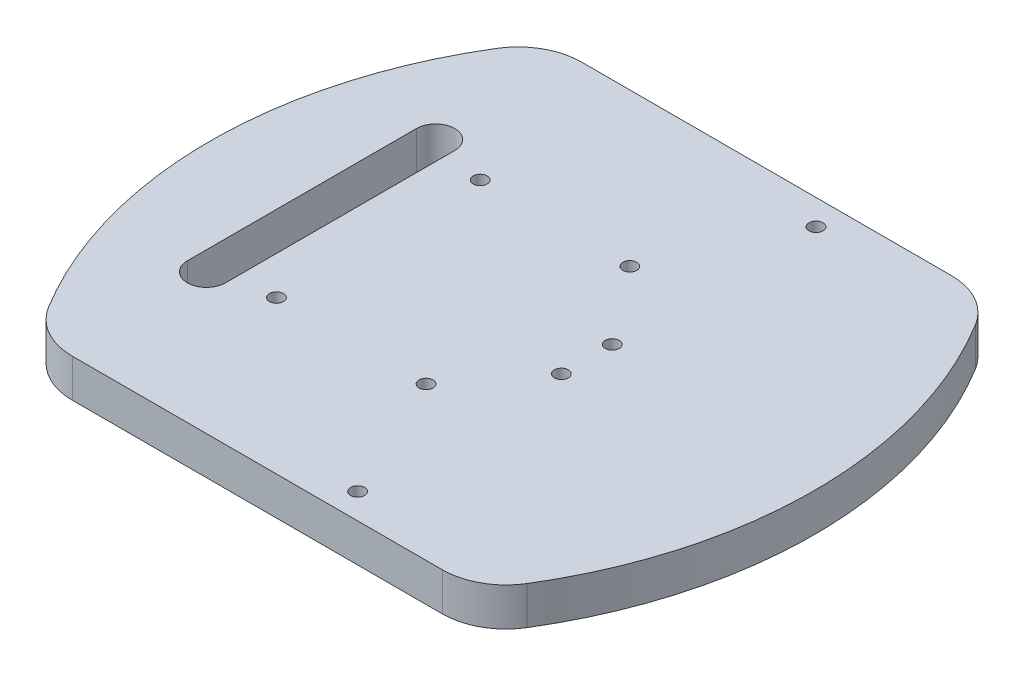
ISO-10303-21;
HEADER;
FILE_DESCRIPTION(('STEP AP214'),'2;1');
FILE_NAME('part.step','',(''),(''),'','','');
FILE_SCHEMA(('AUTOMOTIVE_DESIGN { 1 0 10303 214 1 1 1 1 }'));
ENDSEC;
DATA;
#1=APPLICATION_CONTEXT('core data for automotive mechanical design processes');
#2=APPLICATION_PROTOCOL_DEFINITION('international standard','automotive_design',2000,#1);
#3=PRODUCT_CONTEXT('',#1,'mechanical');
#4=PRODUCT('Part','Part','',(#3));
#5=PRODUCT_RELATED_PRODUCT_CATEGORY('part','',(#4));
#6=PRODUCT_DEFINITION_FORMATION('','',#4);
#7=PRODUCT_DEFINITION_CONTEXT('part definition',#1,'design');
#8=PRODUCT_DEFINITION('design','',#6,#7);
#9=PRODUCT_DEFINITION_SHAPE('','',#8);
#10=(LENGTH_UNIT() NAMED_UNIT(*) SI_UNIT(.MILLI.,.METRE.));
#11=(NAMED_UNIT(*) PLANE_ANGLE_UNIT() SI_UNIT($,.RADIAN.));
#12=(NAMED_UNIT(*) SI_UNIT($,.STERADIAN.) SOLID_ANGLE_UNIT());
#13=UNCERTAINTY_MEASURE_WITH_UNIT(LENGTH_MEASURE(1.E-05),#10,'distance_accuracy_value','');
#14=(GEOMETRIC_REPRESENTATION_CONTEXT(3) GLOBAL_UNCERTAINTY_ASSIGNED_CONTEXT((#13)) GLOBAL_UNIT_ASSIGNED_CONTEXT((#10,
#11,#12)) REPRESENTATION_CONTEXT('',''));
#15=CARTESIAN_POINT('',(0.,0.,0.));
#16=DIRECTION('',(0.,0.,1.));
#17=DIRECTION('',(1.,0.,0.));
#18=AXIS2_PLACEMENT_3D('',#15,#16,#17);
#19=CARTESIAN_POINT('',(-34.0535421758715,6.,30.));
#20=DIRECTION('',(0.,1.,0.));
#21=DIRECTION('',(0.,0.,1.));
#22=AXIS2_PLACEMENT_3D('',#19,#20,#21);
#23=PLANE('',#22);
#24=CARTESIAN_POINT('',(-26.,6.,16.));
#25=DIRECTION('',(0.,1.,0.));
#26=DIRECTION('',(0.,0.,-1.));
#27=AXIS2_PLACEMENT_3D('',#24,#25,#26);
#28=CIRCLE('',#27,1.1);
#29=CARTESIAN_POINT('',(-26.,6.,14.9));
#30=VERTEX_POINT('',#29);
#31=EDGE_CURVE('E162',#30,#30,#28,.T.);
#32=ORIENTED_EDGE('',*,*,#31,.F.);
#33=EDGE_LOOP('',(#32));
#34=FACE_BOUND('',#33,.T.);
#35=CARTESIAN_POINT('',(-26.,6.,-16.));
#36=DIRECTION('',(0.,1.,0.));
#37=DIRECTION('',(0.,0.,1.));
#38=AXIS2_PLACEMENT_3D('',#35,#36,#37);
#39=CIRCLE('',#38,1.1);
#40=CARTESIAN_POINT('',(-26.,6.,-14.9));
#41=VERTEX_POINT('',#40);
#42=EDGE_CURVE('E174',#41,#41,#39,.T.);
#43=ORIENTED_EDGE('',*,*,#42,.F.);
#44=EDGE_LOOP('',(#43));
#45=FACE_BOUND('',#44,.T.);
#46=CARTESIAN_POINT('',(6.75,6.,4.));
#47=DIRECTION('',(0.,1.,0.));
#48=DIRECTION('',(0.,0.,1.));
#49=AXIS2_PLACEMENT_3D('',#46,#47,#48);
#50=CIRCLE('',#49,1.1);
#51=CARTESIAN_POINT('',(6.75,6.,5.1));
#52=VERTEX_POINT('',#51);
#53=EDGE_CURVE('E186',#52,#52,#50,.T.);
#54=ORIENTED_EDGE('',*,*,#53,.F.);
#55=EDGE_LOOP('',(#54));
#56=FACE_BOUND('',#55,.T.);
#57=CARTESIAN_POINT('',(6.75,6.,-4.));
#58=DIRECTION('',(0.,1.,0.));
#59=DIRECTION('',(0.,0.,-1.));
#60=AXIS2_PLACEMENT_3D('',#57,#58,#59);
#61=CIRCLE('',#60,1.1);
#62=CARTESIAN_POINT('',(6.75,6.,-5.1));
#63=VERTEX_POINT('',#62);
#64=EDGE_CURVE('E198',#63,#63,#61,.T.);
#65=ORIENTED_EDGE('',*,*,#64,.F.);
#66=EDGE_LOOP('',(#65));
#67=FACE_BOUND('',#66,.T.);
#68=CARTESIAN_POINT('',(-34.0535421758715,6.,30.));
#69=DIRECTION('',(0.,1.,0.));
#70=DIRECTION('',(0.,0.,1.));
#71=AXIS2_PLACEMENT_3D('',#68,#69,#70);
#72=CIRCLE('',#71,10.);
#73=CARTESIAN_POINT('',(-42.5845929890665,6.,35.2173913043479));
#74=VERTEX_POINT('',#73);
#75=CARTESIAN_POINT('',(-34.0535421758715,6.,40.));
#76=VERTEX_POINT('',#75);
#77=EDGE_CURVE('E224',#74,#76,#72,.T.);
#78=ORIENTED_EDGE('',*,*,#77,.T.);
#79=DIRECTION('',(1.,0.,0.));
#80=VECTOR('',#79,1.);
#81=CARTESIAN_POINT('',(-34.0535421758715,6.,40.));
#82=LINE('',#81,#80);
#83=CARTESIAN_POINT('',(24.0535421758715,6.,40.0000000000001));
#84=VERTEX_POINT('',#83);
#85=EDGE_CURVE('E227',#76,#84,#82,.T.);
#86=ORIENTED_EDGE('',*,*,#85,.T.);
#87=CARTESIAN_POINT('',(24.0535421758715,6.,30.0000000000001));
#88=DIRECTION('',(0.,1.,0.));
#89=DIRECTION('',(0.,0.,-1.));
#90=AXIS2_PLACEMENT_3D('',#87,#88,#89);
#91=CIRCLE('',#90,10.);
#92=CARTESIAN_POINT('',(32.5845929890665,6.,35.2173913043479));
#93=VERTEX_POINT('',#92);
#94=EDGE_CURVE('E229',#84,#93,#91,.T.);
#95=ORIENTED_EDGE('',*,*,#94,.T.);
#96=CARTESIAN_POINT('',(-25.,6.,0.));
#97=DIRECTION('',(0.,1.,0.));
#98=DIRECTION('',(0.,0.,1.));
#99=AXIS2_PLACEMENT_3D('',#96,#97,#98);
#100=CIRCLE('',#99,67.5);
#101=CARTESIAN_POINT('',(32.5845929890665,6.,-35.2173913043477));
#102=VERTEX_POINT('',#101);
#103=EDGE_CURVE('E231',#93,#102,#100,.T.);
#104=ORIENTED_EDGE('',*,*,#103,.T.);
#105=CARTESIAN_POINT('',(24.0535421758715,6.,-29.9999999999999));
#106=DIRECTION('',(0.,1.,0.));
#107=DIRECTION('',(0.,0.,-1.));
#108=AXIS2_PLACEMENT_3D('',#105,#106,#107);
#109=CIRCLE('',#108,10.);
#110=CARTESIAN_POINT('',(24.0535421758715,6.,-39.9999999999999));
#111=VERTEX_POINT('',#110);
#112=EDGE_CURVE('E233',#102,#111,#109,.T.);
#113=ORIENTED_EDGE('',*,*,#112,.T.);
#114=DIRECTION('',(-1.,0.,0.));
#115=VECTOR('',#114,1.);
#116=CARTESIAN_POINT('',(-34.0535421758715,6.,-40.));
#117=LINE('',#116,#115);
#118=CARTESIAN_POINT('',(-34.0535421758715,6.,-40.));
#119=VERTEX_POINT('',#118);
#120=EDGE_CURVE('E235',#111,#119,#117,.T.);
#121=ORIENTED_EDGE('',*,*,#120,.T.);
#122=CARTESIAN_POINT('',(-34.0535421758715,6.,-30.));
#123=DIRECTION('',(0.,1.,0.));
#124=DIRECTION('',(0.,0.,1.));
#125=AXIS2_PLACEMENT_3D('',#122,#123,#124);
#126=CIRCLE('',#125,10.);
#127=CARTESIAN_POINT('',(-42.5845929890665,6.,-35.2173913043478));
#128=VERTEX_POINT('',#127);
#129=EDGE_CURVE('E237',#119,#128,#126,.T.);
#130=ORIENTED_EDGE('',*,*,#129,.T.);
#131=CARTESIAN_POINT('',(15.,6.,0.));
#132=DIRECTION('',(0.,1.,0.));
#133=DIRECTION('',(0.,0.,-1.));
#134=AXIS2_PLACEMENT_3D('',#131,#132,#133);
#135=CIRCLE('',#134,67.5);
#136=EDGE_CURVE('E239',#128,#74,#135,.T.);
#137=ORIENTED_EDGE('',*,*,#136,.T.);
#138=EDGE_LOOP('',(#78,#86,#95,#104,#113,#121,#130,#137));
#139=FACE_BOUND('',#138,.T.);
#140=CARTESIAN_POINT('',(6.75,6.,-36.));
#141=DIRECTION('',(0.,1.,0.));
#142=DIRECTION('',(0.,0.,1.));
#143=AXIS2_PLACEMENT_3D('',#140,#141,#142);
#144=CIRCLE('',#143,1.1);
#145=CARTESIAN_POINT('',(6.75,6.,-34.9));
#146=VERTEX_POINT('',#145);
#147=EDGE_CURVE('E204',#146,#146,#144,.T.);
#148=ORIENTED_EDGE('',*,*,#147,.F.);
#149=EDGE_LOOP('',(#148));
#150=FACE_BOUND('',#149,.T.);
#151=CARTESIAN_POINT('',(6.75,6.,36.));
#152=DIRECTION('',(0.,1.,0.));
#153=DIRECTION('',(0.,0.,-1.));
#154=AXIS2_PLACEMENT_3D('',#151,#152,#153);
#155=CIRCLE('',#154,1.1);
#156=CARTESIAN_POINT('',(6.75,6.,34.9));
#157=VERTEX_POINT('',#156);
#158=EDGE_CURVE('E192',#157,#157,#155,.T.);
#159=ORIENTED_EDGE('',*,*,#158,.F.);
#160=EDGE_LOOP('',(#159));
#161=FACE_BOUND('',#160,.T.);
#162=CARTESIAN_POINT('',(-2.49999999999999,6.,-16.));
#163=DIRECTION('',(0.,1.,0.));
#164=DIRECTION('',(0.,0.,1.));
#165=AXIS2_PLACEMENT_3D('',#162,#163,#164);
#166=CIRCLE('',#165,1.1);
#167=CARTESIAN_POINT('',(-2.49999999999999,6.,-14.9));
#168=VERTEX_POINT('',#167);
#169=EDGE_CURVE('E180',#168,#168,#166,.T.);
#170=ORIENTED_EDGE('',*,*,#169,.F.);
#171=EDGE_LOOP('',(#170));
#172=FACE_BOUND('',#171,.T.);
#173=CARTESIAN_POINT('',(-2.49999999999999,6.,16.));
#174=DIRECTION('',(0.,1.,0.));
#175=DIRECTION('',(0.,0.,-1.));
#176=AXIS2_PLACEMENT_3D('',#173,#174,#175);
#177=CIRCLE('',#176,1.1);
#178=CARTESIAN_POINT('',(-2.49999999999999,6.,14.9));
#179=VERTEX_POINT('',#178);
#180=EDGE_CURVE('E168',#179,#179,#177,.T.);
#181=ORIENTED_EDGE('',*,*,#180,.F.);
#182=EDGE_LOOP('',(#181));
#183=FACE_BOUND('',#182,.T.);
#184=DIRECTION('',(0.,0.,1.));
#185=VECTOR('',#184,1.);
#186=CARTESIAN_POINT('',(-38.,6.,-18.));
#187=LINE('',#186,#185);
#188=CARTESIAN_POINT('',(-38.,6.,-18.));
#189=VERTEX_POINT('',#188);
#190=CARTESIAN_POINT('',(-38.,6.,18.));
#191=VERTEX_POINT('',#190);
#192=EDGE_CURVE('E150',#189,#191,#187,.T.);
#193=ORIENTED_EDGE('',*,*,#192,.F.);
#194=CARTESIAN_POINT('',(-35.,6.,-18.));
#195=DIRECTION('',(0.,1.,0.));
#196=DIRECTION('',(0.,0.,1.));
#197=AXIS2_PLACEMENT_3D('',#194,#195,#196);
#198=CIRCLE('',#197,3.);
#199=CARTESIAN_POINT('',(-32.,6.,-18.));
#200=VERTEX_POINT('',#199);
#201=EDGE_CURVE('E139',#200,#189,#198,.T.);
#202=ORIENTED_EDGE('',*,*,#201,.F.);
#203=DIRECTION('',(0.,0.,-1.));
#204=VECTOR('',#203,1.);
#205=CARTESIAN_POINT('',(-32.,6.,-18.));
#206=LINE('',#205,#204);
#207=CARTESIAN_POINT('',(-32.,6.,18.));
#208=VERTEX_POINT('',#207);
#209=EDGE_CURVE('E154',#208,#200,#206,.T.);
#210=ORIENTED_EDGE('',*,*,#209,.F.);
#211=CARTESIAN_POINT('',(-35.,6.,18.));
#212=DIRECTION('',(0.,1.,0.));
#213=DIRECTION('',(0.,0.,-1.));
#214=AXIS2_PLACEMENT_3D('',#211,#212,#213);
#215=CIRCLE('',#214,3.);
#216=EDGE_CURVE('E152',#191,#208,#215,.T.);
#217=ORIENTED_EDGE('',*,*,#216,.F.);
#218=EDGE_LOOP('',(#193,#202,#210,#217));
#219=FACE_BOUND('',#218,.T.);
#220=ADVANCED_FACE('F35',(#34,#45,#56,#67,#139,#150,#161,#172,#183,#219),#23,.T.);
#221=CARTESIAN_POINT('',(-34.0535421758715,0.,30.));
#222=DIRECTION('',(0.,1.,0.));
#223=DIRECTION('',(0.,0.,1.));
#224=AXIS2_PLACEMENT_3D('',#221,#222,#223);
#225=PLANE('',#224);
#226=CARTESIAN_POINT('',(-26.,0.,16.));
#227=DIRECTION('',(0.,1.,0.));
#228=DIRECTION('',(0.,0.,-1.));
#229=AXIS2_PLACEMENT_3D('',#226,#227,#228);
#230=CIRCLE('',#229,1.1);
#231=CARTESIAN_POINT('',(-26.,0.,14.9));
#232=VERTEX_POINT('',#231);
#233=EDGE_CURVE('E140',#232,#232,#230,.T.);
#234=ORIENTED_EDGE('',*,*,#233,.T.);
#235=EDGE_LOOP('',(#234));
#236=FACE_BOUND('',#235,.T.);
#237=CARTESIAN_POINT('',(-26.,0.,-16.));
#238=DIRECTION('',(0.,1.,0.));
#239=DIRECTION('',(0.,0.,1.));
#240=AXIS2_PLACEMENT_3D('',#237,#238,#239);
#241=CIRCLE('',#240,1.1);
#242=CARTESIAN_POINT('',(-26.,0.,-14.9));
#243=VERTEX_POINT('',#242);
#244=EDGE_CURVE('E171',#243,#243,#241,.T.);
#245=ORIENTED_EDGE('',*,*,#244,.T.);
#246=EDGE_LOOP('',(#245));
#247=FACE_BOUND('',#246,.T.);
#248=CARTESIAN_POINT('',(6.75,0.,4.));
#249=DIRECTION('',(0.,1.,0.));
#250=DIRECTION('',(0.,0.,1.));
#251=AXIS2_PLACEMENT_3D('',#248,#249,#250);
#252=CIRCLE('',#251,1.1);
#253=CARTESIAN_POINT('',(6.75,0.,5.1));
#254=VERTEX_POINT('',#253);
#255=EDGE_CURVE('E183',#254,#254,#252,.T.);
#256=ORIENTED_EDGE('',*,*,#255,.T.);
#257=EDGE_LOOP('',(#256));
#258=FACE_BOUND('',#257,.T.);
#259=CARTESIAN_POINT('',(6.75,0.,-4.));
#260=DIRECTION('',(0.,1.,0.));
#261=DIRECTION('',(0.,0.,-1.));
#262=AXIS2_PLACEMENT_3D('',#259,#260,#261);
#263=CIRCLE('',#262,1.1);
#264=CARTESIAN_POINT('',(6.75,0.,-5.1));
#265=VERTEX_POINT('',#264);
#266=EDGE_CURVE('E195',#265,#265,#263,.T.);
#267=ORIENTED_EDGE('',*,*,#266,.T.);
#268=EDGE_LOOP('',(#267));
#269=FACE_BOUND('',#268,.T.);
#270=CARTESIAN_POINT('',(-34.0535421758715,0.,30.));
#271=DIRECTION('',(0.,1.,0.));
#272=DIRECTION('',(0.,0.,1.));
#273=AXIS2_PLACEMENT_3D('',#270,#271,#272);
#274=CIRCLE('',#273,10.);
#275=CARTESIAN_POINT('',(-42.5845929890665,0.,35.2173913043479));
#276=VERTEX_POINT('',#275);
#277=CARTESIAN_POINT('',(-34.0535421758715,0.,40.));
#278=VERTEX_POINT('',#277);
#279=EDGE_CURVE('E207',#276,#278,#274,.T.);
#280=ORIENTED_EDGE('',*,*,#279,.F.);
#281=CARTESIAN_POINT('',(15.,0.,0.));
#282=DIRECTION('',(0.,1.,0.));
#283=DIRECTION('',(0.,0.,-1.));
#284=AXIS2_PLACEMENT_3D('',#281,#282,#283);
#285=CIRCLE('',#284,67.5);
#286=CARTESIAN_POINT('',(-42.5845929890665,0.,-35.2173913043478));
#287=VERTEX_POINT('',#286);
#288=EDGE_CURVE('E222',#287,#276,#285,.T.);
#289=ORIENTED_EDGE('',*,*,#288,.F.);
#290=CARTESIAN_POINT('',(-34.0535421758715,0.,-30.));
#291=DIRECTION('',(0.,1.,0.));
#292=DIRECTION('',(0.,0.,1.));
#293=AXIS2_PLACEMENT_3D('',#290,#291,#292);
#294=CIRCLE('',#293,10.);
#295=CARTESIAN_POINT('',(-34.0535421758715,0.,-40.));
#296=VERTEX_POINT('',#295);
#297=EDGE_CURVE('E220',#296,#287,#294,.T.);
#298=ORIENTED_EDGE('',*,*,#297,.F.);
#299=DIRECTION('',(-1.,0.,0.));
#300=VECTOR('',#299,1.);
#301=CARTESIAN_POINT('',(-34.0535421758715,0.,-40.));
#302=LINE('',#301,#300);
#303=CARTESIAN_POINT('',(24.0535421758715,0.,-39.9999999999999));
#304=VERTEX_POINT('',#303);
#305=EDGE_CURVE('E218',#304,#296,#302,.T.);
#306=ORIENTED_EDGE('',*,*,#305,.F.);
#307=CARTESIAN_POINT('',(24.0535421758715,0.,-29.9999999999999));
#308=DIRECTION('',(0.,1.,0.));
#309=DIRECTION('',(0.,0.,-1.));
#310=AXIS2_PLACEMENT_3D('',#307,#308,#309);
#311=CIRCLE('',#310,10.);
#312=CARTESIAN_POINT('',(32.5845929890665,0.,-35.2173913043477));
#313=VERTEX_POINT('',#312);
#314=EDGE_CURVE('E216',#313,#304,#311,.T.);
#315=ORIENTED_EDGE('',*,*,#314,.F.);
#316=CARTESIAN_POINT('',(-25.,0.,0.));
#317=DIRECTION('',(0.,1.,0.));
#318=DIRECTION('',(0.,0.,1.));
#319=AXIS2_PLACEMENT_3D('',#316,#317,#318);
#320=CIRCLE('',#319,67.5);
#321=CARTESIAN_POINT('',(32.5845929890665,0.,35.2173913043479));
#322=VERTEX_POINT('',#321);
#323=EDGE_CURVE('E214',#322,#313,#320,.T.);
#324=ORIENTED_EDGE('',*,*,#323,.F.);
#325=CARTESIAN_POINT('',(24.0535421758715,0.,30.0000000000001));
#326=DIRECTION('',(0.,1.,0.));
#327=DIRECTION('',(0.,0.,-1.));
#328=AXIS2_PLACEMENT_3D('',#325,#326,#327);
#329=CIRCLE('',#328,10.);
#330=CARTESIAN_POINT('',(24.0535421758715,0.,40.0000000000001));
#331=VERTEX_POINT('',#330);
#332=EDGE_CURVE('E212',#331,#322,#329,.T.);
#333=ORIENTED_EDGE('',*,*,#332,.F.);
#334=DIRECTION('',(1.,0.,0.));
#335=VECTOR('',#334,1.);
#336=CARTESIAN_POINT('',(-34.0535421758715,0.,40.));
#337=LINE('',#336,#335);
#338=EDGE_CURVE('E210',#278,#331,#337,.T.);
#339=ORIENTED_EDGE('',*,*,#338,.F.);
#340=EDGE_LOOP('',(#280,#289,#298,#306,#315,#324,#333,#339));
#341=FACE_BOUND('',#340,.T.);
#342=CARTESIAN_POINT('',(6.75,0.,-36.));
#343=DIRECTION('',(0.,1.,0.));
#344=DIRECTION('',(0.,0.,1.));
#345=AXIS2_PLACEMENT_3D('',#342,#343,#344);
#346=CIRCLE('',#345,1.1);
#347=CARTESIAN_POINT('',(6.75,0.,-34.9));
#348=VERTEX_POINT('',#347);
#349=EDGE_CURVE('E201',#348,#348,#346,.T.);
#350=ORIENTED_EDGE('',*,*,#349,.T.);
#351=EDGE_LOOP('',(#350));
#352=FACE_BOUND('',#351,.T.);
#353=CARTESIAN_POINT('',(6.75,0.,36.));
#354=DIRECTION('',(0.,1.,0.));
#355=DIRECTION('',(0.,0.,-1.));
#356=AXIS2_PLACEMENT_3D('',#353,#354,#355);
#357=CIRCLE('',#356,1.1);
#358=CARTESIAN_POINT('',(6.75,0.,34.9));
#359=VERTEX_POINT('',#358);
#360=EDGE_CURVE('E189',#359,#359,#357,.T.);
#361=ORIENTED_EDGE('',*,*,#360,.T.);
#362=EDGE_LOOP('',(#361));
#363=FACE_BOUND('',#362,.T.);
#364=CARTESIAN_POINT('',(-2.49999999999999,0.,-16.));
#365=DIRECTION('',(0.,1.,0.));
#366=DIRECTION('',(0.,0.,1.));
#367=AXIS2_PLACEMENT_3D('',#364,#365,#366);
#368=CIRCLE('',#367,1.1);
#369=CARTESIAN_POINT('',(-2.49999999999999,0.,-14.9));
#370=VERTEX_POINT('',#369);
#371=EDGE_CURVE('E177',#370,#370,#368,.T.);
#372=ORIENTED_EDGE('',*,*,#371,.T.);
#373=EDGE_LOOP('',(#372));
#374=FACE_BOUND('',#373,.T.);
#375=CARTESIAN_POINT('',(-2.49999999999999,0.,16.));
#376=DIRECTION('',(0.,1.,0.));
#377=DIRECTION('',(0.,0.,-1.));
#378=AXIS2_PLACEMENT_3D('',#375,#376,#377);
#379=CIRCLE('',#378,1.1);
#380=CARTESIAN_POINT('',(-2.49999999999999,0.,14.9));
#381=VERTEX_POINT('',#380);
#382=EDGE_CURVE('E165',#381,#381,#379,.T.);
#383=ORIENTED_EDGE('',*,*,#382,.T.);
#384=EDGE_LOOP('',(#383));
#385=FACE_BOUND('',#384,.T.);
#386=CARTESIAN_POINT('',(-35.,0.,-18.));
#387=DIRECTION('',(0.,1.,0.));
#388=DIRECTION('',(0.,0.,1.));
#389=AXIS2_PLACEMENT_3D('',#386,#387,#388);
#390=CIRCLE('',#389,3.);
#391=CARTESIAN_POINT('',(-32.,0.,-18.));
#392=VERTEX_POINT('',#391);
#393=CARTESIAN_POINT('',(-38.,0.,-18.));
#394=VERTEX_POINT('',#393);
#395=EDGE_CURVE('E58',#392,#394,#390,.T.);
#396=ORIENTED_EDGE('',*,*,#395,.T.);
#397=DIRECTION('',(0.,0.,1.));
#398=VECTOR('',#397,1.);
#399=CARTESIAN_POINT('',(-38.,0.,-18.));
#400=LINE('',#399,#398);
#401=CARTESIAN_POINT('',(-38.,0.,18.));
#402=VERTEX_POINT('',#401);
#403=EDGE_CURVE('E126',#394,#402,#400,.T.);
#404=ORIENTED_EDGE('',*,*,#403,.T.);
#405=CARTESIAN_POINT('',(-35.,0.,18.));
#406=DIRECTION('',(0.,1.,0.));
#407=DIRECTION('',(0.,0.,-1.));
#408=AXIS2_PLACEMENT_3D('',#405,#406,#407);
#409=CIRCLE('',#408,3.);
#410=CARTESIAN_POINT('',(-32.,0.,18.));
#411=VERTEX_POINT('',#410);
#412=EDGE_CURVE('E135',#402,#411,#409,.T.);
#413=ORIENTED_EDGE('',*,*,#412,.T.);
#414=DIRECTION('',(0.,0.,-1.));
#415=VECTOR('',#414,1.);
#416=CARTESIAN_POINT('',(-32.,0.,-18.));
#417=LINE('',#416,#415);
#418=EDGE_CURVE('E144',#411,#392,#417,.T.);
#419=ORIENTED_EDGE('',*,*,#418,.T.);
#420=EDGE_LOOP('',(#396,#404,#413,#419));
#421=FACE_BOUND('',#420,.T.);
#422=ADVANCED_FACE('F143',(#236,#247,#258,#269,#341,#352,#363,#374,#385,#421),#225,.F.);
#423=CARTESIAN_POINT('',(-34.0535421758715,6.,30.));
#424=DIRECTION('',(0.,-1.,0.));
#425=DIRECTION('',(0.,0.,-1.));
#426=AXIS2_PLACEMENT_3D('',#423,#424,#425);
#427=CYLINDRICAL_SURFACE('',#426,10.);
#428=ORIENTED_EDGE('',*,*,#279,.T.);
#429=DIRECTION('',(0.,-1.,0.));
#430=VECTOR('',#429,1.);
#431=CARTESIAN_POINT('',(-34.0535421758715,6.,40.));
#432=LINE('',#431,#430);
#433=EDGE_CURVE('E11',#76,#278,#432,.T.);
#434=ORIENTED_EDGE('',*,*,#433,.F.);
#435=ORIENTED_EDGE('',*,*,#77,.F.);
#436=DIRECTION('',(0.,-1.,0.));
#437=VECTOR('',#436,1.);
#438=CARTESIAN_POINT('',(-42.5845929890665,6.,35.2173913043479));
#439=LINE('',#438,#437);
#440=EDGE_CURVE('E241',#74,#276,#439,.T.);
#441=ORIENTED_EDGE('',*,*,#440,.T.);
#442=EDGE_LOOP('',(#428,#434,#435,#441));
#443=FACE_BOUND('',#442,.T.);
#444=ADVANCED_FACE('F37',(#443),#427,.T.);
#445=CARTESIAN_POINT('',(-34.0535421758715,6.,40.));
#446=DIRECTION('',(0.,0.,-1.));
#447=DIRECTION('',(-1.,0.,0.));
#448=AXIS2_PLACEMENT_3D('',#445,#446,#447);
#449=PLANE('',#448);
#450=ORIENTED_EDGE('',*,*,#338,.T.);
#451=DIRECTION('',(0.,-1.,0.));
#452=VECTOR('',#451,1.);
#453=CARTESIAN_POINT('',(24.0535421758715,6.,40.0000000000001));
#454=LINE('',#453,#452);
#455=EDGE_CURVE('E43',#84,#331,#454,.T.);
#456=ORIENTED_EDGE('',*,*,#455,.F.);
#457=ORIENTED_EDGE('',*,*,#85,.F.);
#458=ORIENTED_EDGE('',*,*,#433,.T.);
#459=EDGE_LOOP('',(#450,#456,#457,#458));
#460=FACE_BOUND('',#459,.T.);
#461=ADVANCED_FACE('F286',(#460),#449,.F.);
#462=CARTESIAN_POINT('',(24.0535421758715,6.,30.0000000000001));
#463=DIRECTION('',(0.,-1.,0.));
#464=DIRECTION('',(0.,0.,-1.));
#465=AXIS2_PLACEMENT_3D('',#462,#463,#464);
#466=CYLINDRICAL_SURFACE('',#465,10.);
#467=ORIENTED_EDGE('',*,*,#332,.T.);
#468=DIRECTION('',(0.,-1.,0.));
#469=VECTOR('',#468,1.);
#470=CARTESIAN_POINT('',(32.5845929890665,6.,35.2173913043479));
#471=LINE('',#470,#469);
#472=EDGE_CURVE('E256',#93,#322,#471,.T.);
#473=ORIENTED_EDGE('',*,*,#472,.F.);
#474=ORIENTED_EDGE('',*,*,#94,.F.);
#475=ORIENTED_EDGE('',*,*,#455,.T.);
#476=EDGE_LOOP('',(#467,#473,#474,#475));
#477=FACE_BOUND('',#476,.T.);
#478=ADVANCED_FACE('F263',(#477),#466,.T.);
#479=CARTESIAN_POINT('',(-25.,6.,0.));
#480=DIRECTION('',(0.,-1.,0.));
#481=DIRECTION('',(0.,0.,-1.));
#482=AXIS2_PLACEMENT_3D('',#479,#480,#481);
#483=CYLINDRICAL_SURFACE('',#482,67.5);
#484=ORIENTED_EDGE('',*,*,#323,.T.);
#485=DIRECTION('',(0.,-1.,0.));
#486=VECTOR('',#485,1.);
#487=CARTESIAN_POINT('',(32.5845929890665,6.,-35.2173913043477));
#488=LINE('',#487,#486);
#489=EDGE_CURVE('E253',#102,#313,#488,.T.);
#490=ORIENTED_EDGE('',*,*,#489,.F.);
#491=ORIENTED_EDGE('',*,*,#103,.F.);
#492=ORIENTED_EDGE('',*,*,#472,.T.);
#493=EDGE_LOOP('',(#484,#490,#491,#492));
#494=FACE_BOUND('',#493,.T.);
#495=ADVANCED_FACE('F274',(#494),#483,.T.);
#496=CARTESIAN_POINT('',(24.0535421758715,6.,-29.9999999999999));
#497=DIRECTION('',(0.,-1.,0.));
#498=DIRECTION('',(0.,0.,-1.));
#499=AXIS2_PLACEMENT_3D('',#496,#497,#498);
#500=CYLINDRICAL_SURFACE('',#499,10.);
#501=ORIENTED_EDGE('',*,*,#314,.T.);
#502=DIRECTION('',(0.,-1.,0.));
#503=VECTOR('',#502,1.);
#504=CARTESIAN_POINT('',(24.0535421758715,6.,-39.9999999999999));
#505=LINE('',#504,#503);
#506=EDGE_CURVE('E250',#111,#304,#505,.T.);
#507=ORIENTED_EDGE('',*,*,#506,.F.);
#508=ORIENTED_EDGE('',*,*,#112,.F.);
#509=ORIENTED_EDGE('',*,*,#489,.T.);
#510=EDGE_LOOP('',(#501,#507,#508,#509));
#511=FACE_BOUND('',#510,.T.);
#512=ADVANCED_FACE('F278',(#511),#500,.T.);
#513=CARTESIAN_POINT('',(-34.0535421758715,6.,-40.));
#514=DIRECTION('',(0.,0.,1.));
#515=DIRECTION('',(1.,0.,0.));
#516=AXIS2_PLACEMENT_3D('',#513,#514,#515);
#517=PLANE('',#516);
#518=ORIENTED_EDGE('',*,*,#305,.T.);
#519=DIRECTION('',(0.,-1.,0.));
#520=VECTOR('',#519,1.);
#521=CARTESIAN_POINT('',(-34.0535421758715,6.,-40.));
#522=LINE('',#521,#520);
#523=EDGE_CURVE('E247',#119,#296,#522,.T.);
#524=ORIENTED_EDGE('',*,*,#523,.F.);
#525=ORIENTED_EDGE('',*,*,#120,.F.);
#526=ORIENTED_EDGE('',*,*,#506,.T.);
#527=EDGE_LOOP('',(#518,#524,#525,#526));
#528=FACE_BOUND('',#527,.T.);
#529=ADVANCED_FACE('F299',(#528),#517,.F.);
#530=CARTESIAN_POINT('',(-34.0535421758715,6.,-30.));
#531=DIRECTION('',(0.,-1.,0.));
#532=DIRECTION('',(0.,0.,-1.));
#533=AXIS2_PLACEMENT_3D('',#530,#531,#532);
#534=CYLINDRICAL_SURFACE('',#533,10.);
#535=ORIENTED_EDGE('',*,*,#297,.T.);
#536=DIRECTION('',(0.,-1.,0.));
#537=VECTOR('',#536,1.);
#538=CARTESIAN_POINT('',(-42.5845929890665,6.,-35.2173913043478));
#539=LINE('',#538,#537);
#540=EDGE_CURVE('E244',#128,#287,#539,.T.);
#541=ORIENTED_EDGE('',*,*,#540,.F.);
#542=ORIENTED_EDGE('',*,*,#129,.F.);
#543=ORIENTED_EDGE('',*,*,#523,.T.);
#544=EDGE_LOOP('',(#535,#541,#542,#543));
#545=FACE_BOUND('',#544,.T.);
#546=ADVANCED_FACE('F297',(#545),#534,.T.);
#547=CARTESIAN_POINT('',(15.,6.,0.));
#548=DIRECTION('',(0.,-1.,0.));
#549=DIRECTION('',(0.,0.,-1.));
#550=AXIS2_PLACEMENT_3D('',#547,#548,#549);
#551=CYLINDRICAL_SURFACE('',#550,67.5);
#552=ORIENTED_EDGE('',*,*,#288,.T.);
#553=ORIENTED_EDGE('',*,*,#440,.F.);
#554=ORIENTED_EDGE('',*,*,#136,.F.);
#555=ORIENTED_EDGE('',*,*,#540,.T.);
#556=EDGE_LOOP('',(#552,#553,#554,#555));
#557=FACE_BOUND('',#556,.T.);
#558=ADVANCED_FACE('F292',(#557),#551,.T.);
#559=CARTESIAN_POINT('',(6.75,6.,-36.));
#560=DIRECTION('',(0.,-1.,0.));
#561=DIRECTION('',(0.,0.,-1.));
#562=AXIS2_PLACEMENT_3D('',#559,#560,#561);
#563=CYLINDRICAL_SURFACE('',#562,1.1);
#564=ORIENTED_EDGE('',*,*,#147,.T.);
#565=EDGE_LOOP('',(#564));
#566=FACE_BOUND('',#565,.T.);
#567=ORIENTED_EDGE('',*,*,#349,.F.);
#568=EDGE_LOOP('',(#567));
#569=FACE_BOUND('',#568,.T.);
#570=ADVANCED_FACE('F321',(#566,#569),#563,.F.);
#571=CARTESIAN_POINT('',(6.75,6.,-4.));
#572=DIRECTION('',(0.,-1.,0.));
#573=DIRECTION('',(0.,0.,-1.));
#574=AXIS2_PLACEMENT_3D('',#571,#572,#573);
#575=CYLINDRICAL_SURFACE('',#574,1.1);
#576=ORIENTED_EDGE('',*,*,#64,.T.);
#577=EDGE_LOOP('',(#576));
#578=FACE_BOUND('',#577,.T.);
#579=ORIENTED_EDGE('',*,*,#266,.F.);
#580=EDGE_LOOP('',(#579));
#581=FACE_BOUND('',#580,.T.);
#582=ADVANCED_FACE('F325',(#578,#581),#575,.F.);
#583=CARTESIAN_POINT('',(6.75,6.,36.));
#584=DIRECTION('',(0.,-1.,0.));
#585=DIRECTION('',(0.,0.,-1.));
#586=AXIS2_PLACEMENT_3D('',#583,#584,#585);
#587=CYLINDRICAL_SURFACE('',#586,1.1);
#588=ORIENTED_EDGE('',*,*,#158,.T.);
#589=EDGE_LOOP('',(#588));
#590=FACE_BOUND('',#589,.T.);
#591=ORIENTED_EDGE('',*,*,#360,.F.);
#592=EDGE_LOOP('',(#591));
#593=FACE_BOUND('',#592,.T.);
#594=ADVANCED_FACE('F330',(#590,#593),#587,.F.);
#595=CARTESIAN_POINT('',(6.75,6.,4.));
#596=DIRECTION('',(0.,-1.,0.));
#597=DIRECTION('',(0.,0.,-1.));
#598=AXIS2_PLACEMENT_3D('',#595,#596,#597);
#599=CYLINDRICAL_SURFACE('',#598,1.1);
#600=ORIENTED_EDGE('',*,*,#53,.T.);
#601=EDGE_LOOP('',(#600));
#602=FACE_BOUND('',#601,.T.);
#603=ORIENTED_EDGE('',*,*,#255,.F.);
#604=EDGE_LOOP('',(#603));
#605=FACE_BOUND('',#604,.T.);
#606=ADVANCED_FACE('F337',(#602,#605),#599,.F.);
#607=CARTESIAN_POINT('',(-2.49999999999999,6.,-16.));
#608=DIRECTION('',(0.,-1.,0.));
#609=DIRECTION('',(0.,0.,-1.));
#610=AXIS2_PLACEMENT_3D('',#607,#608,#609);
#611=CYLINDRICAL_SURFACE('',#610,1.1);
#612=ORIENTED_EDGE('',*,*,#169,.T.);
#613=EDGE_LOOP('',(#612));
#614=FACE_BOUND('',#613,.T.);
#615=ORIENTED_EDGE('',*,*,#371,.F.);
#616=EDGE_LOOP('',(#615));
#617=FACE_BOUND('',#616,.T.);
#618=ADVANCED_FACE('F341',(#614,#617),#611,.F.);
#619=CARTESIAN_POINT('',(-26.,6.,-16.));
#620=DIRECTION('',(0.,-1.,0.));
#621=DIRECTION('',(0.,0.,-1.));
#622=AXIS2_PLACEMENT_3D('',#619,#620,#621);
#623=CYLINDRICAL_SURFACE('',#622,1.1);
#624=ORIENTED_EDGE('',*,*,#42,.T.);
#625=EDGE_LOOP('',(#624));
#626=FACE_BOUND('',#625,.T.);
#627=ORIENTED_EDGE('',*,*,#244,.F.);
#628=EDGE_LOOP('',(#627));
#629=FACE_BOUND('',#628,.T.);
#630=ADVANCED_FACE('F345',(#626,#629),#623,.F.);
#631=CARTESIAN_POINT('',(-2.49999999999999,6.,16.));
#632=DIRECTION('',(0.,-1.,0.));
#633=DIRECTION('',(0.,0.,-1.));
#634=AXIS2_PLACEMENT_3D('',#631,#632,#633);
#635=CYLINDRICAL_SURFACE('',#634,1.1);
#636=ORIENTED_EDGE('',*,*,#180,.T.);
#637=EDGE_LOOP('',(#636));
#638=FACE_BOUND('',#637,.T.);
#639=ORIENTED_EDGE('',*,*,#382,.F.);
#640=EDGE_LOOP('',(#639));
#641=FACE_BOUND('',#640,.T.);
#642=ADVANCED_FACE('F349',(#638,#641),#635,.F.);
#643=CARTESIAN_POINT('',(-26.,6.,16.));
#644=DIRECTION('',(0.,-1.,0.));
#645=DIRECTION('',(0.,0.,-1.));
#646=AXIS2_PLACEMENT_3D('',#643,#644,#645);
#647=CYLINDRICAL_SURFACE('',#646,1.1);
#648=ORIENTED_EDGE('',*,*,#31,.T.);
#649=EDGE_LOOP('',(#648));
#650=FACE_BOUND('',#649,.T.);
#651=ORIENTED_EDGE('',*,*,#233,.F.);
#652=EDGE_LOOP('',(#651));
#653=FACE_BOUND('',#652,.T.);
#654=ADVANCED_FACE('F353',(#650,#653),#647,.F.);
#655=CARTESIAN_POINT('',(-35.,6.,-18.));
#656=DIRECTION('',(0.,-1.,0.));
#657=DIRECTION('',(0.,0.,-1.));
#658=AXIS2_PLACEMENT_3D('',#655,#656,#657);
#659=CYLINDRICAL_SURFACE('',#658,3.);
#660=ORIENTED_EDGE('',*,*,#395,.F.);
#661=DIRECTION('',(0.,-1.,0.));
#662=VECTOR('',#661,1.);
#663=CARTESIAN_POINT('',(-32.,6.,-18.));
#664=LINE('',#663,#662);
#665=EDGE_CURVE('E156',#200,#392,#664,.T.);
#666=ORIENTED_EDGE('',*,*,#665,.F.);
#667=ORIENTED_EDGE('',*,*,#201,.T.);
#668=DIRECTION('',(0.,-1.,0.));
#669=VECTOR('',#668,1.);
#670=CARTESIAN_POINT('',(-38.,6.,-18.));
#671=LINE('',#670,#669);
#672=EDGE_CURVE('E128',#189,#394,#671,.T.);
#673=ORIENTED_EDGE('',*,*,#672,.T.);
#674=EDGE_LOOP('',(#660,#666,#667,#673));
#675=FACE_BOUND('',#674,.T.);
#676=ADVANCED_FACE('F137',(#675),#659,.F.);
#677=CARTESIAN_POINT('',(-38.,6.,-18.));
#678=DIRECTION('',(1.,0.,0.));
#679=DIRECTION('',(0.,0.,-1.));
#680=AXIS2_PLACEMENT_3D('',#677,#678,#679);
#681=PLANE('',#680);
#682=ORIENTED_EDGE('',*,*,#403,.F.);
#683=ORIENTED_EDGE('',*,*,#672,.F.);
#684=ORIENTED_EDGE('',*,*,#192,.T.);
#685=DIRECTION('',(0.,-1.,0.));
#686=VECTOR('',#685,1.);
#687=CARTESIAN_POINT('',(-38.,6.,18.));
#688=LINE('',#687,#686);
#689=EDGE_CURVE('E131',#191,#402,#688,.T.);
#690=ORIENTED_EDGE('',*,*,#689,.T.);
#691=EDGE_LOOP('',(#682,#683,#684,#690));
#692=FACE_BOUND('',#691,.T.);
#693=ADVANCED_FACE('F127',(#692),#681,.T.);
#694=CARTESIAN_POINT('',(-35.,6.,18.));
#695=DIRECTION('',(0.,-1.,0.));
#696=DIRECTION('',(0.,0.,-1.));
#697=AXIS2_PLACEMENT_3D('',#694,#695,#696);
#698=CYLINDRICAL_SURFACE('',#697,3.);
#699=ORIENTED_EDGE('',*,*,#412,.F.);
#700=ORIENTED_EDGE('',*,*,#689,.F.);
#701=ORIENTED_EDGE('',*,*,#216,.T.);
#702=DIRECTION('',(0.,-1.,0.));
#703=VECTOR('',#702,1.);
#704=CARTESIAN_POINT('',(-32.,6.,18.));
#705=LINE('',#704,#703);
#706=EDGE_CURVE('E50',#208,#411,#705,.T.);
#707=ORIENTED_EDGE('',*,*,#706,.T.);
#708=EDGE_LOOP('',(#699,#700,#701,#707));
#709=FACE_BOUND('',#708,.T.);
#710=ADVANCED_FACE('F362',(#709),#698,.F.);
#711=CARTESIAN_POINT('',(-32.,6.,-18.));
#712=DIRECTION('',(-1.,0.,0.));
#713=DIRECTION('',(0.,0.,1.));
#714=AXIS2_PLACEMENT_3D('',#711,#712,#713);
#715=PLANE('',#714);
#716=ORIENTED_EDGE('',*,*,#418,.F.);
#717=ORIENTED_EDGE('',*,*,#706,.F.);
#718=ORIENTED_EDGE('',*,*,#209,.T.);
#719=ORIENTED_EDGE('',*,*,#665,.T.);
#720=EDGE_LOOP('',(#716,#717,#718,#719));
#721=FACE_BOUND('',#720,.T.);
#722=ADVANCED_FACE('F365',(#721),#715,.T.);
#723=CLOSED_SHELL('',(#220,#422,#444,#461,#478,#495,#512,#529,#546,#558,#570,#582,#594,#606,
#618,#630,#642,#654,#676,#693,#710,#722));
#724=MANIFOLD_SOLID_BREP('B2',#723);
#725=ADVANCED_BREP_SHAPE_REPRESENTATION('',(#18,#724),#14);
#726=SHAPE_DEFINITION_REPRESENTATION(#9,#725);
ENDSEC;
END-ISO-10303-21;
